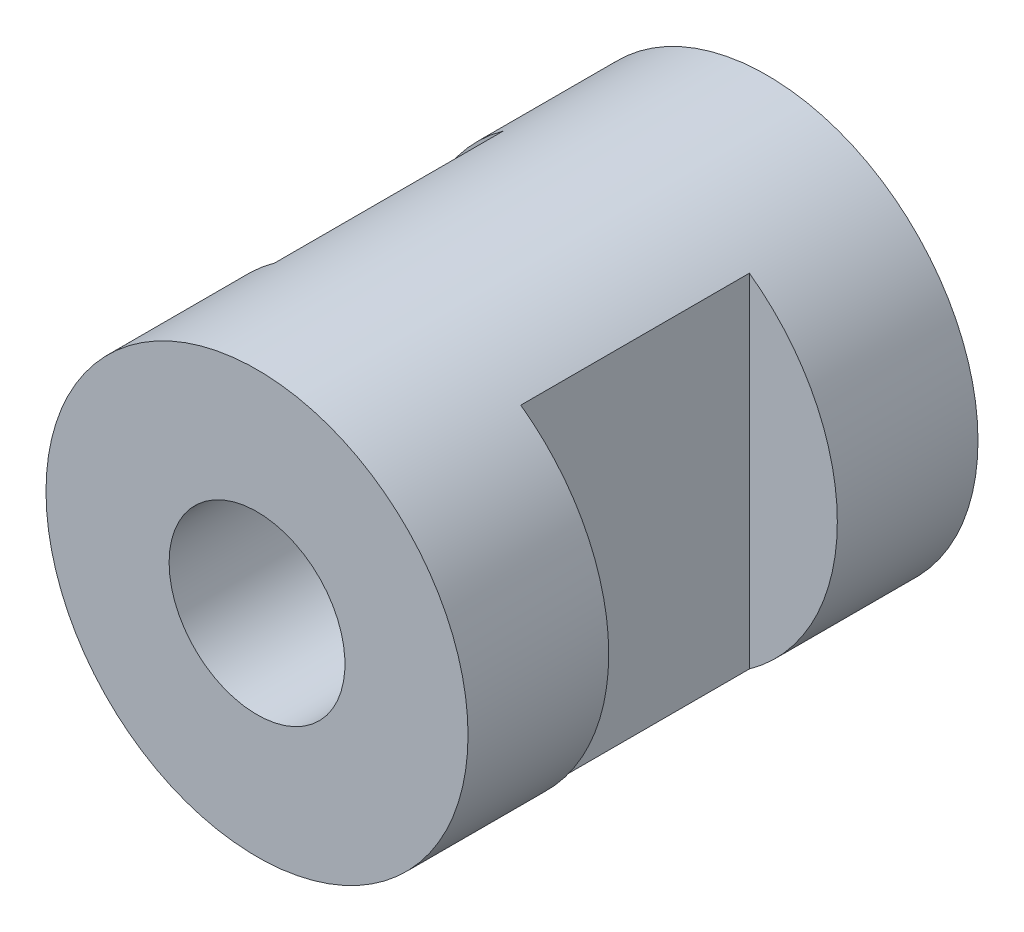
ISO-10303-21;
HEADER;
FILE_DESCRIPTION(('STEP AP214'),'2;1');
FILE_NAME('part.step','',(''),(''),'','','');
FILE_SCHEMA(('AUTOMOTIVE_DESIGN { 1 0 10303 214 1 1 1 1 }'));
ENDSEC;
DATA;
#1=APPLICATION_CONTEXT('core data for automotive mechanical design processes');
#2=APPLICATION_PROTOCOL_DEFINITION('international standard','automotive_design',2000,#1);
#3=PRODUCT_CONTEXT('',#1,'mechanical');
#4=PRODUCT('Part','Part','',(#3));
#5=PRODUCT_RELATED_PRODUCT_CATEGORY('part','',(#4));
#6=PRODUCT_DEFINITION_FORMATION('','',#4);
#7=PRODUCT_DEFINITION_CONTEXT('part definition',#1,'design');
#8=PRODUCT_DEFINITION('design','',#6,#7);
#9=PRODUCT_DEFINITION_SHAPE('','',#8);
#10=(LENGTH_UNIT() NAMED_UNIT(*) SI_UNIT(.MILLI.,.METRE.));
#11=(NAMED_UNIT(*) PLANE_ANGLE_UNIT() SI_UNIT($,.RADIAN.));
#12=(NAMED_UNIT(*) SI_UNIT($,.STERADIAN.) SOLID_ANGLE_UNIT());
#13=UNCERTAINTY_MEASURE_WITH_UNIT(LENGTH_MEASURE(1.E-05),#10,'distance_accuracy_value','');
#14=(GEOMETRIC_REPRESENTATION_CONTEXT(3) GLOBAL_UNCERTAINTY_ASSIGNED_CONTEXT((#13)) GLOBAL_UNIT_ASSIGNED_CONTEXT((#10,
#11,#12)) REPRESENTATION_CONTEXT('',''));
#15=CARTESIAN_POINT('',(0.,0.,0.));
#16=DIRECTION('',(0.,0.,1.));
#17=DIRECTION('',(1.,0.,0.));
#18=AXIS2_PLACEMENT_3D('',#15,#16,#17);
#19=CARTESIAN_POINT('',(0.,0.,14.5));
#20=DIRECTION('',(0.,0.,-1.));
#21=DIRECTION('',(-1.,0.,0.));
#22=AXIS2_PLACEMENT_3D('',#19,#20,#21);
#23=CYLINDRICAL_SURFACE('',#22,6.);
#24=CARTESIAN_POINT('',(0.,0.,10.5));
#25=DIRECTION('',(0.,0.,1.));
#26=DIRECTION('',(1.,0.,0.));
#27=AXIS2_PLACEMENT_3D('',#24,#25,#26);
#28=CIRCLE('',#27,6.);
#29=CARTESIAN_POINT('',(-3.5,4.87339717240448,10.5));
#30=VERTEX_POINT('',#29);
#31=CARTESIAN_POINT('',(-3.5,-4.87339717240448,10.5));
#32=VERTEX_POINT('',#31);
#33=EDGE_CURVE('E39',#30,#32,#28,.T.);
#34=ORIENTED_EDGE('',*,*,#33,.T.);
#35=DIRECTION('',(0.,0.,-1.));
#36=VECTOR('',#35,1.);
#37=CARTESIAN_POINT('',(-3.5,-4.87339717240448,14.5));
#38=LINE('',#37,#36);
#39=CARTESIAN_POINT('',(-3.5,-4.87339717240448,4.00000000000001));
#40=VERTEX_POINT('',#39);
#41=EDGE_CURVE('E11',#32,#40,#38,.T.);
#42=ORIENTED_EDGE('',*,*,#41,.T.);
#43=CARTESIAN_POINT('',(0.,0.,4.00000000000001));
#44=DIRECTION('',(0.,0.,-1.));
#45=DIRECTION('',(-1.,0.,0.));
#46=AXIS2_PLACEMENT_3D('',#43,#44,#45);
#47=CIRCLE('',#46,6.);
#48=CARTESIAN_POINT('',(-3.5,4.87339717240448,4.00000000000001));
#49=VERTEX_POINT('',#48);
#50=EDGE_CURVE('E83',#40,#49,#47,.T.);
#51=ORIENTED_EDGE('',*,*,#50,.T.);
#52=DIRECTION('',(0.,0.,-1.));
#53=VECTOR('',#52,1.);
#54=CARTESIAN_POINT('',(-3.5,4.87339717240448,14.5));
#55=LINE('',#54,#53);
#56=EDGE_CURVE('E82',#49,#30,#55,.F.);
#57=ORIENTED_EDGE('',*,*,#56,.T.);
#58=EDGE_LOOP('',(#34,#42,#51,#57));
#59=FACE_BOUND('',#58,.T.);
#60=DIRECTION('',(0.,0.,-1.));
#61=VECTOR('',#60,1.);
#62=CARTESIAN_POINT('',(3.5,-4.87339717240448,14.5));
#63=LINE('',#62,#61);
#64=CARTESIAN_POINT('',(3.5,-4.87339717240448,4.));
#65=VERTEX_POINT('',#64);
#66=CARTESIAN_POINT('',(3.5,-4.87339717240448,10.5));
#67=VERTEX_POINT('',#66);
#68=EDGE_CURVE('E93',#65,#67,#63,.F.);
#69=ORIENTED_EDGE('',*,*,#68,.T.);
#70=CARTESIAN_POINT('',(0.,0.,10.5));
#71=DIRECTION('',(0.,0.,1.));
#72=DIRECTION('',(1.,0.,0.));
#73=AXIS2_PLACEMENT_3D('',#70,#71,#72);
#74=CIRCLE('',#73,6.);
#75=CARTESIAN_POINT('',(3.5,4.87339717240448,10.5));
#76=VERTEX_POINT('',#75);
#77=EDGE_CURVE('E87',#67,#76,#74,.T.);
#78=ORIENTED_EDGE('',*,*,#77,.T.);
#79=DIRECTION('',(0.,0.,-1.));
#80=VECTOR('',#79,1.);
#81=CARTESIAN_POINT('',(3.5,4.87339717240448,14.5));
#82=LINE('',#81,#80);
#83=CARTESIAN_POINT('',(3.5,4.87339717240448,4.));
#84=VERTEX_POINT('',#83);
#85=EDGE_CURVE('E90',#76,#84,#82,.T.);
#86=ORIENTED_EDGE('',*,*,#85,.T.);
#87=CARTESIAN_POINT('',(0.,0.,4.));
#88=DIRECTION('',(0.,0.,-1.));
#89=DIRECTION('',(-1.,0.,0.));
#90=AXIS2_PLACEMENT_3D('',#87,#88,#89);
#91=CIRCLE('',#90,6.);
#92=EDGE_CURVE('E96',#84,#65,#91,.T.);
#93=ORIENTED_EDGE('',*,*,#92,.T.);
#94=EDGE_LOOP('',(#69,#78,#86,#93));
#95=FACE_BOUND('',#94,.T.);
#96=CARTESIAN_POINT('',(0.,0.,14.5));
#97=DIRECTION('',(0.,0.,1.));
#98=DIRECTION('',(1.,0.,0.));
#99=AXIS2_PLACEMENT_3D('',#96,#97,#98);
#100=CIRCLE('',#99,6.);
#101=CARTESIAN_POINT('',(6.,0.,14.5));
#102=VERTEX_POINT('',#101);
#103=EDGE_CURVE('E99',#102,#102,#100,.T.);
#104=ORIENTED_EDGE('',*,*,#103,.F.);
#105=EDGE_LOOP('',(#104));
#106=FACE_BOUND('',#105,.T.);
#107=CARTESIAN_POINT('',(0.,0.,0.));
#108=DIRECTION('',(0.,0.,1.));
#109=DIRECTION('',(1.,0.,0.));
#110=AXIS2_PLACEMENT_3D('',#107,#108,#109);
#111=CIRCLE('',#110,6.);
#112=CARTESIAN_POINT('',(6.,0.,0.));
#113=VERTEX_POINT('',#112);
#114=EDGE_CURVE('E100',#113,#113,#111,.T.);
#115=ORIENTED_EDGE('',*,*,#114,.T.);
#116=EDGE_LOOP('',(#115));
#117=FACE_BOUND('',#116,.T.);
#118=ADVANCED_FACE('F32',(#59,#95,#106,#117),#23,.T.);
#119=CARTESIAN_POINT('',(0.,0.,14.5));
#120=DIRECTION('',(0.,0.,1.));
#121=DIRECTION('',(1.,0.,0.));
#122=AXIS2_PLACEMENT_3D('',#119,#120,#121);
#123=PLANE('',#122);
#124=CARTESIAN_POINT('',(0.,0.,14.5));
#125=DIRECTION('',(0.,0.,-1.));
#126=DIRECTION('',(-1.,0.,0.));
#127=AXIS2_PLACEMENT_3D('',#124,#125,#126);
#128=CIRCLE('',#127,2.5);
#129=CARTESIAN_POINT('',(-2.5,0.,14.5));
#130=VERTEX_POINT('',#129);
#131=EDGE_CURVE('E79',#130,#130,#128,.T.);
#132=ORIENTED_EDGE('',*,*,#131,.T.);
#133=EDGE_LOOP('',(#132));
#134=FACE_BOUND('',#133,.T.);
#135=ORIENTED_EDGE('',*,*,#103,.T.);
#136=EDGE_LOOP('',(#135));
#137=FACE_BOUND('',#136,.T.);
#138=ADVANCED_FACE('F116',(#134,#137),#123,.T.);
#139=CARTESIAN_POINT('',(0.,0.,0.));
#140=DIRECTION('',(0.,0.,1.));
#141=DIRECTION('',(1.,0.,0.));
#142=AXIS2_PLACEMENT_3D('',#139,#140,#141);
#143=PLANE('',#142);
#144=CARTESIAN_POINT('',(0.,0.,0.));
#145=DIRECTION('',(0.,0.,-1.));
#146=DIRECTION('',(-1.,0.,0.));
#147=AXIS2_PLACEMENT_3D('',#144,#145,#146);
#148=CIRCLE('',#147,2.5);
#149=CARTESIAN_POINT('',(-2.5,0.,0.));
#150=VERTEX_POINT('',#149);
#151=EDGE_CURVE('E110',#150,#150,#148,.T.);
#152=ORIENTED_EDGE('',*,*,#151,.F.);
#153=EDGE_LOOP('',(#152));
#154=FACE_BOUND('',#153,.T.);
#155=ORIENTED_EDGE('',*,*,#114,.F.);
#156=EDGE_LOOP('',(#155));
#157=FACE_BOUND('',#156,.T.);
#158=ADVANCED_FACE('F125',(#154,#157),#143,.F.);
#159=CARTESIAN_POINT('',(6.75643546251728,-6.,10.5));
#160=DIRECTION('',(0.,0.,1.));
#161=DIRECTION('',(1.,0.,0.));
#162=AXIS2_PLACEMENT_3D('',#159,#160,#161);
#163=PLANE('',#162);
#164=DIRECTION('',(0.,1.,0.));
#165=VECTOR('',#164,1.);
#166=CARTESIAN_POINT('',(3.5,-6.,10.5));
#167=LINE('',#166,#165);
#168=EDGE_CURVE('E103',#67,#76,#167,.T.);
#169=ORIENTED_EDGE('',*,*,#168,.T.);
#170=ORIENTED_EDGE('',*,*,#77,.F.);
#171=EDGE_LOOP('',(#169,#170));
#172=FACE_BOUND('',#171,.T.);
#173=ADVANCED_FACE('F128',(#172),#163,.F.);
#174=CARTESIAN_POINT('',(3.5,-6.,10.5));
#175=DIRECTION('',(-1.,0.,0.));
#176=DIRECTION('',(0.,0.,1.));
#177=AXIS2_PLACEMENT_3D('',#174,#175,#176);
#178=PLANE('',#177);
#179=ORIENTED_EDGE('',*,*,#168,.F.);
#180=ORIENTED_EDGE('',*,*,#68,.F.);
#181=DIRECTION('',(0.,1.,0.));
#182=VECTOR('',#181,1.);
#183=CARTESIAN_POINT('',(3.5,-6.,4.));
#184=LINE('',#183,#182);
#185=EDGE_CURVE('E53',#65,#84,#184,.T.);
#186=ORIENTED_EDGE('',*,*,#185,.T.);
#187=ORIENTED_EDGE('',*,*,#85,.F.);
#188=EDGE_LOOP('',(#179,#180,#186,#187));
#189=FACE_BOUND('',#188,.T.);
#190=ADVANCED_FACE('F142',(#189),#178,.F.);
#191=CARTESIAN_POINT('',(6.75643546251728,-6.,4.));
#192=DIRECTION('',(0.,0.,-1.));
#193=DIRECTION('',(-1.,0.,0.));
#194=AXIS2_PLACEMENT_3D('',#191,#192,#193);
#195=PLANE('',#194);
#196=ORIENTED_EDGE('',*,*,#185,.F.);
#197=ORIENTED_EDGE('',*,*,#92,.F.);
#198=EDGE_LOOP('',(#196,#197));
#199=FACE_BOUND('',#198,.T.);
#200=ADVANCED_FACE('F139',(#199),#195,.F.);
#201=CARTESIAN_POINT('',(-6.75643546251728,-6.,10.5));
#202=DIRECTION('',(0.,0.,1.));
#203=DIRECTION('',(1.,0.,0.));
#204=AXIS2_PLACEMENT_3D('',#201,#202,#203);
#205=PLANE('',#204);
#206=DIRECTION('',(0.,1.,0.));
#207=VECTOR('',#206,1.);
#208=CARTESIAN_POINT('',(-3.5,-6.,10.5));
#209=LINE('',#208,#207);
#210=EDGE_CURVE('E46',#32,#30,#209,.T.);
#211=ORIENTED_EDGE('',*,*,#210,.F.);
#212=ORIENTED_EDGE('',*,*,#33,.F.);
#213=EDGE_LOOP('',(#211,#212));
#214=FACE_BOUND('',#213,.T.);
#215=ADVANCED_FACE('F77',(#214),#205,.F.);
#216=CARTESIAN_POINT('',(-6.75643546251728,-6.,4.00000000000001));
#217=DIRECTION('',(0.,0.,-1.));
#218=DIRECTION('',(-1.,0.,0.));
#219=AXIS2_PLACEMENT_3D('',#216,#217,#218);
#220=PLANE('',#219);
#221=DIRECTION('',(0.,1.,0.));
#222=VECTOR('',#221,1.);
#223=CARTESIAN_POINT('',(-3.5,-6.,4.00000000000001));
#224=LINE('',#223,#222);
#225=EDGE_CURVE('E72',#40,#49,#224,.T.);
#226=ORIENTED_EDGE('',*,*,#225,.T.);
#227=ORIENTED_EDGE('',*,*,#50,.F.);
#228=EDGE_LOOP('',(#226,#227));
#229=FACE_BOUND('',#228,.T.);
#230=ADVANCED_FACE('F151',(#229),#220,.F.);
#231=CARTESIAN_POINT('',(-3.5,-6.,10.5));
#232=DIRECTION('',(1.,0.,0.));
#233=DIRECTION('',(0.,0.,-1.));
#234=AXIS2_PLACEMENT_3D('',#231,#232,#233);
#235=PLANE('',#234);
#236=ORIENTED_EDGE('',*,*,#210,.T.);
#237=ORIENTED_EDGE('',*,*,#56,.F.);
#238=ORIENTED_EDGE('',*,*,#225,.F.);
#239=ORIENTED_EDGE('',*,*,#41,.F.);
#240=EDGE_LOOP('',(#236,#237,#238,#239));
#241=FACE_BOUND('',#240,.T.);
#242=ADVANCED_FACE('F70',(#241),#235,.F.);
#243=CARTESIAN_POINT('',(0.,0.,14.5));
#244=DIRECTION('',(0.,0.,-1.));
#245=DIRECTION('',(-1.,0.,0.));
#246=AXIS2_PLACEMENT_3D('',#243,#244,#245);
#247=CYLINDRICAL_SURFACE('',#246,2.5);
#248=CARTESIAN_POINT('',(-2.5,0.,14.5));
#249=CARTESIAN_POINT('',(-2.5,0.,14.3489583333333));
#250=CARTESIAN_POINT('',(-2.5,0.,14.1979166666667));
#251=CARTESIAN_POINT('',(-2.5,0.,13.8958333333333));
#252=CARTESIAN_POINT('',(-2.5,0.,13.7447916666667));
#253=CARTESIAN_POINT('',(-2.5,0.,13.4427083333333));
#254=CARTESIAN_POINT('',(-2.5,0.,13.2916666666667));
#255=CARTESIAN_POINT('',(-2.5,0.,12.9895833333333));
#256=CARTESIAN_POINT('',(-2.5,0.,12.8385416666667));
#257=CARTESIAN_POINT('',(-2.5,0.,12.5364583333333));
#258=CARTESIAN_POINT('',(-2.5,0.,12.3854166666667));
#259=CARTESIAN_POINT('',(-2.5,0.,12.0833333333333));
#260=CARTESIAN_POINT('',(-2.5,0.,11.9322916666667));
#261=CARTESIAN_POINT('',(-2.5,0.,11.6302083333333));
#262=CARTESIAN_POINT('',(-2.5,0.,11.4791666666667));
#263=CARTESIAN_POINT('',(-2.5,0.,11.1770833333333));
#264=CARTESIAN_POINT('',(-2.5,0.,11.0260416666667));
#265=CARTESIAN_POINT('',(-2.5,0.,10.7239583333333));
#266=CARTESIAN_POINT('',(-2.5,0.,10.5729166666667));
#267=CARTESIAN_POINT('',(-2.5,0.,10.2708333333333));
#268=CARTESIAN_POINT('',(-2.5,0.,10.1197916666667));
#269=CARTESIAN_POINT('',(-2.5,0.,9.81770833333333));
#270=CARTESIAN_POINT('',(-2.5,0.,9.66666666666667));
#271=CARTESIAN_POINT('',(-2.5,0.,9.36458333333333));
#272=CARTESIAN_POINT('',(-2.5,0.,9.21354166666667));
#273=CARTESIAN_POINT('',(-2.5,0.,8.91145833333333));
#274=CARTESIAN_POINT('',(-2.5,0.,8.76041666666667));
#275=CARTESIAN_POINT('',(-2.5,0.,8.45833333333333));
#276=CARTESIAN_POINT('',(-2.5,0.,8.30729166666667));
#277=CARTESIAN_POINT('',(-2.5,0.,8.00520833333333));
#278=CARTESIAN_POINT('',(-2.5,0.,7.85416666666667));
#279=CARTESIAN_POINT('',(-2.5,0.,7.55208333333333));
#280=CARTESIAN_POINT('',(-2.5,0.,7.40104166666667));
#281=CARTESIAN_POINT('',(-2.5,0.,7.09895833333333));
#282=CARTESIAN_POINT('',(-2.5,0.,6.94791666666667));
#283=CARTESIAN_POINT('',(-2.5,0.,6.64583333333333));
#284=CARTESIAN_POINT('',(-2.5,0.,6.49479166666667));
#285=CARTESIAN_POINT('',(-2.5,0.,6.19270833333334));
#286=CARTESIAN_POINT('',(-2.5,0.,6.04166666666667));
#287=CARTESIAN_POINT('',(-2.5,0.,5.73958333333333));
#288=CARTESIAN_POINT('',(-2.5,0.,5.58854166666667));
#289=CARTESIAN_POINT('',(-2.5,0.,5.28645833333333));
#290=CARTESIAN_POINT('',(-2.5,0.,5.13541666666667));
#291=CARTESIAN_POINT('',(-2.5,0.,4.83333333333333));
#292=CARTESIAN_POINT('',(-2.5,0.,4.68229166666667));
#293=CARTESIAN_POINT('',(-2.5,0.,4.38020833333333));
#294=CARTESIAN_POINT('',(-2.5,0.,4.22916666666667));
#295=CARTESIAN_POINT('',(-2.5,0.,3.92708333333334));
#296=CARTESIAN_POINT('',(-2.5,0.,3.77604166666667));
#297=CARTESIAN_POINT('',(-2.5,0.,3.47395833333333));
#298=CARTESIAN_POINT('',(-2.5,0.,3.32291666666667));
#299=CARTESIAN_POINT('',(-2.5,0.,3.02083333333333));
#300=CARTESIAN_POINT('',(-2.5,0.,2.86979166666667));
#301=CARTESIAN_POINT('',(-2.5,0.,2.56770833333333));
#302=CARTESIAN_POINT('',(-2.5,0.,2.41666666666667));
#303=CARTESIAN_POINT('',(-2.5,0.,2.11458333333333));
#304=CARTESIAN_POINT('',(-2.5,0.,1.96354166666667));
#305=CARTESIAN_POINT('',(-2.5,0.,1.66145833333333));
#306=CARTESIAN_POINT('',(-2.5,0.,1.51041666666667));
#307=CARTESIAN_POINT('',(-2.5,0.,1.20833333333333));
#308=CARTESIAN_POINT('',(-2.5,0.,1.05729166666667));
#309=CARTESIAN_POINT('',(-2.5,0.,0.755208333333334));
#310=CARTESIAN_POINT('',(-2.5,0.,0.604166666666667));
#311=CARTESIAN_POINT('',(-2.5,0.,0.302083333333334));
#312=CARTESIAN_POINT('',(-2.5,0.,0.151041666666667));
#313=CARTESIAN_POINT('',(-2.5,0.,0.));
#314=B_SPLINE_CURVE_WITH_KNOTS('',3,(#248,#249,#250,#251,#252,#253,#254,#255,#256,#257,#258,
#259,#260,#261,#262,#263,#264,#265,#266,#267,#268,#269,#270,#271,#272,#273,#274,#275,#276,#277,
#278,#279,#280,#281,#282,#283,#284,#285,#286,#287,#288,#289,#290,#291,#292,#293,#294,#295,#296,
#297,#298,#299,#300,#301,#302,#303,#304,#305,#306,#307,#308,#309,#310,#311,#312,#313),
.UNSPECIFIED.,.F.,.F.,(4,2,2,2,2,2,2,2,2,2,2,2,2,2,2,2,2,2,2,2,2,2,2,2,2,2,2,2,2,2,2,2,4),(0.,
0.453125,0.906250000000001,1.359375,1.8125,2.265625,2.71875,3.171875,3.625,4.078125,4.53125,
4.984375,5.4375,5.890625,6.34375,6.796875,7.25,7.703125,8.15625,8.609375,9.0625,9.515625,
9.96875,10.421875,10.875,11.328125,11.78125,12.234375,12.6875,13.140625,13.59375,14.046875,
14.5),.UNSPECIFIED.);
#315=EDGE_CURVE('BSEAM119',#130,#150,#314,.T.);
#316=ORIENTED_EDGE('',*,*,#131,.F.);
#317=ORIENTED_EDGE('',*,*,#151,.T.);
#318=ORIENTED_EDGE('',*,*,#315,.T.);
#319=ORIENTED_EDGE('',*,*,#315,.F.);
#320=EDGE_LOOP('',(#316,#318,#317,#319));
#321=FACE_BOUND('',#320,.T.);
#322=ADVANCED_FACE('F119',(#321),#247,.F.);
#323=CLOSED_SHELL('',(#118,#138,#158,#173,#190,#200,#215,#230,#242,#322));
#324=MANIFOLD_SOLID_BREP('B2',#323);
#325=ADVANCED_BREP_SHAPE_REPRESENTATION('',(#18,#324),#14);
#326=SHAPE_DEFINITION_REPRESENTATION(#9,#325);
ENDSEC;
END-ISO-10303-21;
